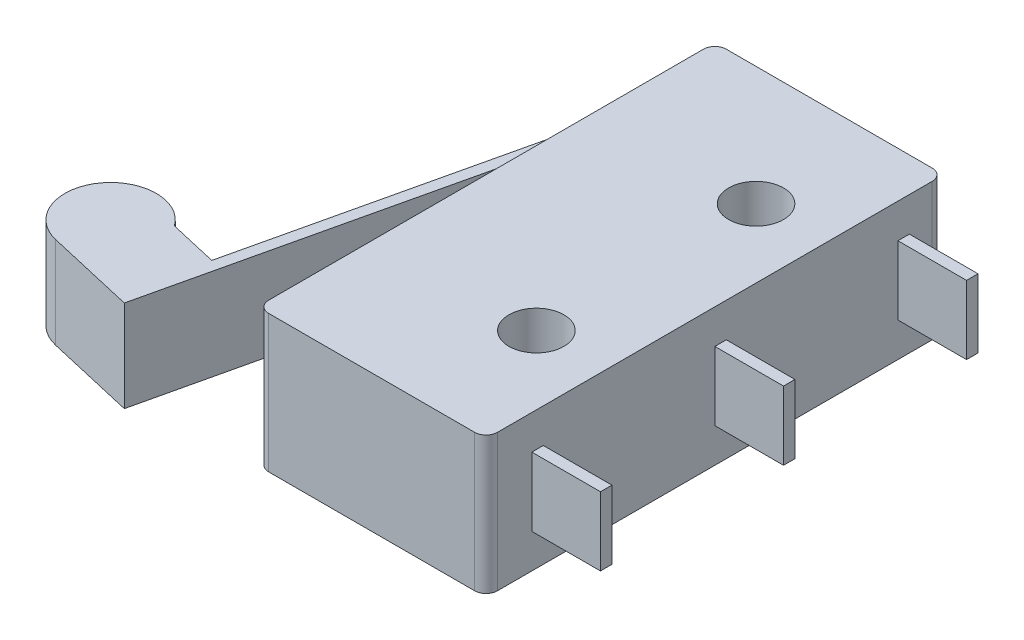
ISO-10303-21;
HEADER;
FILE_DESCRIPTION(('STEP AP214'),'2;1');
FILE_NAME('part.step','',(''),(''),'','','');
FILE_SCHEMA(('AUTOMOTIVE_DESIGN { 1 0 10303 214 1 1 1 1 }'));
ENDSEC;
DATA;
#1=APPLICATION_CONTEXT('core data for automotive mechanical design processes');
#2=APPLICATION_PROTOCOL_DEFINITION('international standard','automotive_design',2000,#1);
#3=PRODUCT_CONTEXT('',#1,'mechanical');
#4=PRODUCT('Part','Part','',(#3));
#5=PRODUCT_RELATED_PRODUCT_CATEGORY('part','',(#4));
#6=PRODUCT_DEFINITION_FORMATION('','',#4);
#7=PRODUCT_DEFINITION_CONTEXT('part definition',#1,'design');
#8=PRODUCT_DEFINITION('design','',#6,#7);
#9=PRODUCT_DEFINITION_SHAPE('','',#8);
#10=(LENGTH_UNIT() NAMED_UNIT(*) SI_UNIT(.MILLI.,.METRE.));
#11=(NAMED_UNIT(*) PLANE_ANGLE_UNIT() SI_UNIT($,.RADIAN.));
#12=(NAMED_UNIT(*) SI_UNIT($,.STERADIAN.) SOLID_ANGLE_UNIT());
#13=UNCERTAINTY_MEASURE_WITH_UNIT(LENGTH_MEASURE(1.E-05),#10,'distance_accuracy_value','');
#14=(GEOMETRIC_REPRESENTATION_CONTEXT(3) GLOBAL_UNCERTAINTY_ASSIGNED_CONTEXT((#13)) GLOBAL_UNIT_ASSIGNED_CONTEXT((#10,
#11,#12)) REPRESENTATION_CONTEXT('',''));
#15=CARTESIAN_POINT('',(0.,0.,0.));
#16=DIRECTION('',(0.,0.,1.));
#17=DIRECTION('',(1.,0.,0.));
#18=AXIS2_PLACEMENT_3D('',#15,#16,#17);
#19=CARTESIAN_POINT('',(0.,3.,0.));
#20=DIRECTION('',(0.,-1.,0.));
#21=DIRECTION('',(0.,0.,-1.));
#22=AXIS2_PLACEMENT_3D('',#19,#20,#21);
#23=PLANE('',#22);
#24=DIRECTION('',(-1.,0.,0.));
#25=VECTOR('',#24,1.);
#26=CARTESIAN_POINT('',(-5.,3.,-10.));
#27=LINE('',#26,#25);
#28=CARTESIAN_POINT('',(4.5,3.,-10.));
#29=VERTEX_POINT('',#28);
#30=CARTESIAN_POINT('',(-4.5,3.,-10.));
#31=VERTEX_POINT('',#30);
#32=EDGE_CURVE('E434',#29,#31,#27,.T.);
#33=ORIENTED_EDGE('',*,*,#32,.T.);
#34=CARTESIAN_POINT('',(-4.5,3.,-9.5));
#35=DIRECTION('',(0.,-1.,0.));
#36=DIRECTION('',(0.,0.,-1.));
#37=AXIS2_PLACEMENT_3D('',#34,#35,#36);
#38=CIRCLE('',#37,0.5);
#39=CARTESIAN_POINT('',(-5.,3.,-9.5));
#40=VERTEX_POINT('',#39);
#41=EDGE_CURVE('E496',#31,#40,#38,.F.);
#42=ORIENTED_EDGE('',*,*,#41,.T.);
#43=DIRECTION('',(0.,0.,1.));
#44=VECTOR('',#43,1.);
#45=CARTESIAN_POINT('',(-5.,3.,10.));
#46=LINE('',#45,#44);
#47=CARTESIAN_POINT('',(-5.,3.,9.5));
#48=VERTEX_POINT('',#47);
#49=EDGE_CURVE('E439',#40,#48,#46,.T.);
#50=ORIENTED_EDGE('',*,*,#49,.T.);
#51=CARTESIAN_POINT('',(-4.5,3.,9.5));
#52=DIRECTION('',(0.,-1.,0.));
#53=DIRECTION('',(0.,0.,-1.));
#54=AXIS2_PLACEMENT_3D('',#51,#52,#53);
#55=CIRCLE('',#54,0.5);
#56=CARTESIAN_POINT('',(-4.5,3.,10.));
#57=VERTEX_POINT('',#56);
#58=EDGE_CURVE('E487',#48,#57,#55,.F.);
#59=ORIENTED_EDGE('',*,*,#58,.T.);
#60=DIRECTION('',(1.,0.,0.));
#61=VECTOR('',#60,1.);
#62=CARTESIAN_POINT('',(-5.,3.,10.));
#63=LINE('',#62,#61);
#64=CARTESIAN_POINT('',(4.5,3.,10.));
#65=VERTEX_POINT('',#64);
#66=EDGE_CURVE('E443',#57,#65,#63,.T.);
#67=ORIENTED_EDGE('',*,*,#66,.T.);
#68=CARTESIAN_POINT('',(4.5,3.,9.5));
#69=DIRECTION('',(0.,-1.,0.));
#70=DIRECTION('',(0.,0.,-1.));
#71=AXIS2_PLACEMENT_3D('',#68,#69,#70);
#72=CIRCLE('',#71,0.5);
#73=CARTESIAN_POINT('',(5.,3.,9.5));
#74=VERTEX_POINT('',#73);
#75=EDGE_CURVE('E490',#65,#74,#72,.F.);
#76=ORIENTED_EDGE('',*,*,#75,.T.);
#77=DIRECTION('',(0.,0.,-1.));
#78=VECTOR('',#77,1.);
#79=CARTESIAN_POINT('',(5.,3.,10.));
#80=LINE('',#79,#78);
#81=CARTESIAN_POINT('',(5.,3.,-9.5));
#82=VERTEX_POINT('',#81);
#83=EDGE_CURVE('E430',#74,#82,#80,.T.);
#84=ORIENTED_EDGE('',*,*,#83,.T.);
#85=CARTESIAN_POINT('',(4.5,3.,-9.5));
#86=DIRECTION('',(0.,-1.,0.));
#87=DIRECTION('',(0.,0.,-1.));
#88=AXIS2_PLACEMENT_3D('',#85,#86,#87);
#89=CIRCLE('',#88,0.5);
#90=EDGE_CURVE('E493',#82,#29,#89,.F.);
#91=ORIENTED_EDGE('',*,*,#90,.T.);
#92=EDGE_LOOP('',(#33,#42,#50,#59,#67,#76,#84,#91));
#93=FACE_BOUND('',#92,.T.);
#94=CARTESIAN_POINT('',(2.,3.,-4.8));
#95=DIRECTION('',(0.,1.,0.));
#96=DIRECTION('',(0.,0.,1.));
#97=AXIS2_PLACEMENT_3D('',#94,#95,#96);
#98=CIRCLE('',#97,1.2);
#99=CARTESIAN_POINT('',(2.,3.,-3.6));
#100=VERTEX_POINT('',#99);
#101=EDGE_CURVE('E422',#100,#100,#98,.T.);
#102=ORIENTED_EDGE('',*,*,#101,.F.);
#103=EDGE_LOOP('',(#102));
#104=FACE_BOUND('',#103,.T.);
#105=CARTESIAN_POINT('',(2.,3.,4.8));
#106=DIRECTION('',(0.,1.,0.));
#107=DIRECTION('',(0.,0.,1.));
#108=AXIS2_PLACEMENT_3D('',#105,#106,#107);
#109=CIRCLE('',#108,1.2);
#110=CARTESIAN_POINT('',(2.,3.,6.));
#111=VERTEX_POINT('',#110);
#112=EDGE_CURVE('E414',#111,#111,#109,.T.);
#113=ORIENTED_EDGE('',*,*,#112,.F.);
#114=EDGE_LOOP('',(#113));
#115=FACE_BOUND('',#114,.T.);
#116=ADVANCED_FACE('F49',(#93,#104,#115),#23,.F.);
#117=CARTESIAN_POINT('',(0.,-3.,0.));
#118=DIRECTION('',(0.,-1.,0.));
#119=DIRECTION('',(0.,0.,-1.));
#120=AXIS2_PLACEMENT_3D('',#117,#118,#119);
#121=PLANE('',#120);
#122=CARTESIAN_POINT('',(2.,-3.,-4.8));
#123=DIRECTION('',(0.,1.,0.));
#124=DIRECTION('',(0.,0.,1.));
#125=AXIS2_PLACEMENT_3D('',#122,#123,#124);
#126=CIRCLE('',#125,1.2);
#127=CARTESIAN_POINT('',(2.,-3.,-3.6));
#128=VERTEX_POINT('',#127);
#129=EDGE_CURVE('E418',#128,#128,#126,.T.);
#130=ORIENTED_EDGE('',*,*,#129,.T.);
#131=EDGE_LOOP('',(#130));
#132=FACE_BOUND('',#131,.T.);
#133=DIRECTION('',(0.,0.,1.));
#134=VECTOR('',#133,1.);
#135=CARTESIAN_POINT('',(-5.,-3.,10.));
#136=LINE('',#135,#134);
#137=CARTESIAN_POINT('',(-5.,-3.,-9.5));
#138=VERTEX_POINT('',#137);
#139=CARTESIAN_POINT('',(-5.,-3.,9.5));
#140=VERTEX_POINT('',#139);
#141=EDGE_CURVE('E455',#138,#140,#136,.T.);
#142=ORIENTED_EDGE('',*,*,#141,.F.);
#143=CARTESIAN_POINT('',(-4.5,-3.,-9.5));
#144=DIRECTION('',(0.,-1.,0.));
#145=DIRECTION('',(0.,0.,-1.));
#146=AXIS2_PLACEMENT_3D('',#143,#144,#145);
#147=CIRCLE('',#146,0.5);
#148=CARTESIAN_POINT('',(-4.5,-3.,-10.));
#149=VERTEX_POINT('',#148);
#150=EDGE_CURVE('E477',#138,#149,#147,.T.);
#151=ORIENTED_EDGE('',*,*,#150,.T.);
#152=DIRECTION('',(-1.,0.,0.));
#153=VECTOR('',#152,1.);
#154=CARTESIAN_POINT('',(-5.,-3.,-10.));
#155=LINE('',#154,#153);
#156=CARTESIAN_POINT('',(4.5,-3.,-10.));
#157=VERTEX_POINT('',#156);
#158=EDGE_CURVE('E451',#157,#149,#155,.T.);
#159=ORIENTED_EDGE('',*,*,#158,.F.);
#160=CARTESIAN_POINT('',(4.5,-3.,-9.5));
#161=DIRECTION('',(0.,-1.,0.));
#162=DIRECTION('',(0.,0.,-1.));
#163=AXIS2_PLACEMENT_3D('',#160,#161,#162);
#164=CIRCLE('',#163,0.5);
#165=CARTESIAN_POINT('',(5.,-3.,-9.5));
#166=VERTEX_POINT('',#165);
#167=EDGE_CURVE('E474',#157,#166,#164,.T.);
#168=ORIENTED_EDGE('',*,*,#167,.T.);
#169=DIRECTION('',(0.,0.,-1.));
#170=VECTOR('',#169,1.);
#171=CARTESIAN_POINT('',(5.,-3.,10.));
#172=LINE('',#171,#170);
#173=CARTESIAN_POINT('',(5.,-3.,9.5));
#174=VERTEX_POINT('',#173);
#175=EDGE_CURVE('E426',#174,#166,#172,.T.);
#176=ORIENTED_EDGE('',*,*,#175,.F.);
#177=CARTESIAN_POINT('',(4.5,-3.,9.5));
#178=DIRECTION('',(0.,-1.,0.));
#179=DIRECTION('',(0.,0.,-1.));
#180=AXIS2_PLACEMENT_3D('',#177,#178,#179);
#181=CIRCLE('',#180,0.5);
#182=CARTESIAN_POINT('',(4.5,-3.,10.));
#183=VERTEX_POINT('',#182);
#184=EDGE_CURVE('E471',#174,#183,#181,.T.);
#185=ORIENTED_EDGE('',*,*,#184,.T.);
#186=DIRECTION('',(1.,0.,0.));
#187=VECTOR('',#186,1.);
#188=CARTESIAN_POINT('',(-5.,-3.,10.));
#189=LINE('',#188,#187);
#190=CARTESIAN_POINT('',(-4.5,-3.,10.));
#191=VERTEX_POINT('',#190);
#192=EDGE_CURVE('E435',#191,#183,#189,.T.);
#193=ORIENTED_EDGE('',*,*,#192,.F.);
#194=CARTESIAN_POINT('',(-4.5,-3.,9.5));
#195=DIRECTION('',(0.,-1.,0.));
#196=DIRECTION('',(0.,0.,-1.));
#197=AXIS2_PLACEMENT_3D('',#194,#195,#196);
#198=CIRCLE('',#197,0.5);
#199=EDGE_CURVE('E468',#191,#140,#198,.T.);
#200=ORIENTED_EDGE('',*,*,#199,.T.);
#201=EDGE_LOOP('',(#142,#151,#159,#168,#176,#185,#193,#200));
#202=FACE_BOUND('',#201,.T.);
#203=CARTESIAN_POINT('',(2.,-3.,4.8));
#204=DIRECTION('',(0.,1.,0.));
#205=DIRECTION('',(0.,0.,1.));
#206=AXIS2_PLACEMENT_3D('',#203,#204,#205);
#207=CIRCLE('',#206,1.2);
#208=CARTESIAN_POINT('',(2.,-3.,6.));
#209=VERTEX_POINT('',#208);
#210=EDGE_CURVE('E413',#209,#209,#207,.T.);
#211=ORIENTED_EDGE('',*,*,#210,.T.);
#212=EDGE_LOOP('',(#211));
#213=FACE_BOUND('',#212,.T.);
#214=ADVANCED_FACE('F517',(#132,#202,#213),#121,.T.);
#215=CARTESIAN_POINT('',(5.,3.,10.));
#216=DIRECTION('',(-1.,0.,0.));
#217=DIRECTION('',(0.,0.,1.));
#218=AXIS2_PLACEMENT_3D('',#215,#216,#217);
#219=PLANE('',#218);
#220=DIRECTION('',(0.,-1.,0.));
#221=VECTOR('',#220,1.);
#222=CARTESIAN_POINT('',(5.,1.5,8.));
#223=LINE('',#222,#221);
#224=CARTESIAN_POINT('',(5.,1.5,8.));
#225=VERTEX_POINT('',#224);
#226=CARTESIAN_POINT('',(5.,-1.5,8.));
#227=VERTEX_POINT('',#226);
#228=EDGE_CURVE('E65',#225,#227,#223,.T.);
#229=ORIENTED_EDGE('',*,*,#228,.F.);
#230=DIRECTION('',(0.,0.,1.));
#231=VECTOR('',#230,1.);
#232=CARTESIAN_POINT('',(5.,1.5,7.5));
#233=LINE('',#232,#231);
#234=CARTESIAN_POINT('',(5.,1.5,7.5));
#235=VERTEX_POINT('',#234);
#236=EDGE_CURVE('E70',#235,#225,#233,.T.);
#237=ORIENTED_EDGE('',*,*,#236,.F.);
#238=DIRECTION('',(0.,-1.,0.));
#239=VECTOR('',#238,1.);
#240=CARTESIAN_POINT('',(5.,1.5,7.5));
#241=LINE('',#240,#239);
#242=CARTESIAN_POINT('',(5.,-1.5,7.5));
#243=VERTEX_POINT('',#242);
#244=EDGE_CURVE('E245',#235,#243,#241,.T.);
#245=ORIENTED_EDGE('',*,*,#244,.T.);
#246=DIRECTION('',(0.,0.,1.));
#247=VECTOR('',#246,1.);
#248=CARTESIAN_POINT('',(5.,-1.5,7.5));
#249=LINE('',#248,#247);
#250=EDGE_CURVE('E249',#243,#227,#249,.T.);
#251=ORIENTED_EDGE('',*,*,#250,.T.);
#252=EDGE_LOOP('',(#229,#237,#245,#251));
#253=FACE_BOUND('',#252,.T.);
#254=DIRECTION('',(0.,-1.,0.));
#255=VECTOR('',#254,1.);
#256=CARTESIAN_POINT('',(5.,1.5,0.));
#257=LINE('',#256,#255);
#258=CARTESIAN_POINT('',(5.,1.5,0.));
#259=VERTEX_POINT('',#258);
#260=CARTESIAN_POINT('',(5.,-1.5,0.));
#261=VERTEX_POINT('',#260);
#262=EDGE_CURVE('E305',#259,#261,#257,.T.);
#263=ORIENTED_EDGE('',*,*,#262,.F.);
#264=DIRECTION('',(0.,0.,1.));
#265=VECTOR('',#264,1.);
#266=CARTESIAN_POINT('',(5.,1.5,-0.5));
#267=LINE('',#266,#265);
#268=CARTESIAN_POINT('',(5.,1.5,-0.5));
#269=VERTEX_POINT('',#268);
#270=EDGE_CURVE('E268',#269,#259,#267,.T.);
#271=ORIENTED_EDGE('',*,*,#270,.F.);
#272=DIRECTION('',(0.,-1.,0.));
#273=VECTOR('',#272,1.);
#274=CARTESIAN_POINT('',(5.,1.5,-0.5));
#275=LINE('',#274,#273);
#276=CARTESIAN_POINT('',(5.,-1.5,-0.5));
#277=VERTEX_POINT('',#276);
#278=EDGE_CURVE('E283',#269,#277,#275,.T.);
#279=ORIENTED_EDGE('',*,*,#278,.T.);
#280=DIRECTION('',(0.,0.,1.));
#281=VECTOR('',#280,1.);
#282=CARTESIAN_POINT('',(5.,-1.5,-0.5));
#283=LINE('',#282,#281);
#284=EDGE_CURVE('E267',#277,#261,#283,.T.);
#285=ORIENTED_EDGE('',*,*,#284,.T.);
#286=EDGE_LOOP('',(#263,#271,#279,#285));
#287=FACE_BOUND('',#286,.T.);
#288=DIRECTION('',(0.,-1.,0.));
#289=VECTOR('',#288,1.);
#290=CARTESIAN_POINT('',(5.,1.5,-8.));
#291=LINE('',#290,#289);
#292=CARTESIAN_POINT('',(5.,1.5,-8.));
#293=VERTEX_POINT('',#292);
#294=CARTESIAN_POINT('',(5.,-1.5,-8.));
#295=VERTEX_POINT('',#294);
#296=EDGE_CURVE('E347',#293,#295,#291,.T.);
#297=ORIENTED_EDGE('',*,*,#296,.F.);
#298=DIRECTION('',(0.,0.,1.));
#299=VECTOR('',#298,1.);
#300=CARTESIAN_POINT('',(5.,1.5,-8.5));
#301=LINE('',#300,#299);
#302=CARTESIAN_POINT('',(5.,1.5,-8.5));
#303=VERTEX_POINT('',#302);
#304=EDGE_CURVE('E310',#303,#293,#301,.T.);
#305=ORIENTED_EDGE('',*,*,#304,.F.);
#306=DIRECTION('',(0.,-1.,0.));
#307=VECTOR('',#306,1.);
#308=CARTESIAN_POINT('',(5.,1.5,-8.5));
#309=LINE('',#308,#307);
#310=CARTESIAN_POINT('',(5.,-1.5,-8.5));
#311=VERTEX_POINT('',#310);
#312=EDGE_CURVE('E325',#303,#311,#309,.T.);
#313=ORIENTED_EDGE('',*,*,#312,.T.);
#314=DIRECTION('',(0.,0.,1.));
#315=VECTOR('',#314,1.);
#316=CARTESIAN_POINT('',(5.,-1.5,-8.5));
#317=LINE('',#316,#315);
#318=EDGE_CURVE('E309',#311,#295,#317,.T.);
#319=ORIENTED_EDGE('',*,*,#318,.T.);
#320=EDGE_LOOP('',(#297,#305,#313,#319));
#321=FACE_BOUND('',#320,.T.);
#322=ORIENTED_EDGE('',*,*,#175,.T.);
#323=DIRECTION('',(0.,-1.,0.));
#324=VECTOR('',#323,1.);
#325=CARTESIAN_POINT('',(5.,3.,-9.5));
#326=LINE('',#325,#324);
#327=EDGE_CURVE('E503',#166,#82,#326,.F.);
#328=ORIENTED_EDGE('',*,*,#327,.T.);
#329=ORIENTED_EDGE('',*,*,#83,.F.);
#330=DIRECTION('',(0.,-1.,0.));
#331=VECTOR('',#330,1.);
#332=CARTESIAN_POINT('',(5.,3.,9.5));
#333=LINE('',#332,#331);
#334=EDGE_CURVE('E499',#74,#174,#333,.T.);
#335=ORIENTED_EDGE('',*,*,#334,.T.);
#336=EDGE_LOOP('',(#322,#328,#329,#335));
#337=FACE_BOUND('',#336,.T.);
#338=ADVANCED_FACE('F526',(#253,#287,#321,#337),#219,.F.);
#339=CARTESIAN_POINT('',(-5.,3.,-10.));
#340=DIRECTION('',(0.,0.,1.));
#341=DIRECTION('',(1.,0.,0.));
#342=AXIS2_PLACEMENT_3D('',#339,#340,#341);
#343=PLANE('',#342);
#344=ORIENTED_EDGE('',*,*,#158,.T.);
#345=DIRECTION('',(0.,-1.,0.));
#346=VECTOR('',#345,1.);
#347=CARTESIAN_POINT('',(-4.5,3.,-10.));
#348=LINE('',#347,#346);
#349=EDGE_CURVE('E484',#149,#31,#348,.F.);
#350=ORIENTED_EDGE('',*,*,#349,.T.);
#351=ORIENTED_EDGE('',*,*,#32,.F.);
#352=DIRECTION('',(0.,-1.,0.));
#353=VECTOR('',#352,1.);
#354=CARTESIAN_POINT('',(4.5,3.,-10.));
#355=LINE('',#354,#353);
#356=EDGE_CURVE('E480',#29,#157,#355,.T.);
#357=ORIENTED_EDGE('',*,*,#356,.T.);
#358=EDGE_LOOP('',(#344,#350,#351,#357));
#359=FACE_BOUND('',#358,.T.);
#360=ADVANCED_FACE('F537',(#359),#343,.F.);
#361=CARTESIAN_POINT('',(-5.,3.,10.));
#362=DIRECTION('',(1.,0.,0.));
#363=DIRECTION('',(0.,0.,-1.));
#364=AXIS2_PLACEMENT_3D('',#361,#362,#363);
#365=PLANE('',#364);
#366=DIRECTION('',(0.,-1.,0.));
#367=VECTOR('',#366,1.);
#368=CARTESIAN_POINT('',(-5.,2.,-8.));
#369=LINE('',#368,#367);
#370=CARTESIAN_POINT('',(-5.,2.,-8.));
#371=VERTEX_POINT('',#370);
#372=CARTESIAN_POINT('',(-5.,-2.,-8.));
#373=VERTEX_POINT('',#372);
#374=EDGE_CURVE('E409',#371,#373,#369,.T.);
#375=ORIENTED_EDGE('',*,*,#374,.F.);
#376=DIRECTION('',(0.,0.,-1.));
#377=VECTOR('',#376,1.);
#378=CARTESIAN_POINT('',(-5.,2.,-5.77729425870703));
#379=LINE('',#378,#377);
#380=CARTESIAN_POINT('',(-5.,2.,-5.77729425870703));
#381=VERTEX_POINT('',#380);
#382=EDGE_CURVE('E352',#381,#371,#379,.T.);
#383=ORIENTED_EDGE('',*,*,#382,.F.);
#384=DIRECTION('',(0.,-1.,0.));
#385=VECTOR('',#384,1.);
#386=CARTESIAN_POINT('',(-5.,2.,-5.77729425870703));
#387=LINE('',#386,#385);
#388=CARTESIAN_POINT('',(-5.,-2.,-5.77729425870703));
#389=VERTEX_POINT('',#388);
#390=EDGE_CURVE('E373',#381,#389,#387,.T.);
#391=ORIENTED_EDGE('',*,*,#390,.T.);
#392=DIRECTION('',(0.,0.,-1.));
#393=VECTOR('',#392,1.);
#394=CARTESIAN_POINT('',(-5.,-2.,-5.77729425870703));
#395=LINE('',#394,#393);
#396=EDGE_CURVE('E351',#389,#373,#395,.T.);
#397=ORIENTED_EDGE('',*,*,#396,.T.);
#398=EDGE_LOOP('',(#375,#383,#391,#397));
#399=FACE_BOUND('',#398,.T.);
#400=ORIENTED_EDGE('',*,*,#49,.F.);
#401=DIRECTION('',(0.,-1.,0.));
#402=VECTOR('',#401,1.);
#403=CARTESIAN_POINT('',(-5.,3.,-9.5));
#404=LINE('',#403,#402);
#405=EDGE_CURVE('E464',#40,#138,#404,.T.);
#406=ORIENTED_EDGE('',*,*,#405,.T.);
#407=ORIENTED_EDGE('',*,*,#141,.T.);
#408=DIRECTION('',(0.,-1.,0.));
#409=VECTOR('',#408,1.);
#410=CARTESIAN_POINT('',(-5.,3.,9.5));
#411=LINE('',#410,#409);
#412=EDGE_CURVE('E447',#140,#48,#411,.F.);
#413=ORIENTED_EDGE('',*,*,#412,.T.);
#414=EDGE_LOOP('',(#400,#406,#407,#413));
#415=FACE_BOUND('',#414,.T.);
#416=ADVANCED_FACE('F545',(#399,#415),#365,.F.);
#417=CARTESIAN_POINT('',(-5.,3.,10.));
#418=DIRECTION('',(0.,0.,-1.));
#419=DIRECTION('',(-1.,0.,0.));
#420=AXIS2_PLACEMENT_3D('',#417,#418,#419);
#421=PLANE('',#420);
#422=ORIENTED_EDGE('',*,*,#192,.T.);
#423=DIRECTION('',(0.,-1.,0.));
#424=VECTOR('',#423,1.);
#425=CARTESIAN_POINT('',(4.5,3.,10.));
#426=LINE('',#425,#424);
#427=EDGE_CURVE('E11',#183,#65,#426,.F.);
#428=ORIENTED_EDGE('',*,*,#427,.T.);
#429=ORIENTED_EDGE('',*,*,#66,.F.);
#430=DIRECTION('',(0.,-1.,0.));
#431=VECTOR('',#430,1.);
#432=CARTESIAN_POINT('',(-4.5,3.,10.));
#433=LINE('',#432,#431);
#434=EDGE_CURVE('E58',#57,#191,#433,.T.);
#435=ORIENTED_EDGE('',*,*,#434,.T.);
#436=EDGE_LOOP('',(#422,#428,#429,#435));
#437=FACE_BOUND('',#436,.T.);
#438=ADVANCED_FACE('F511',(#437),#421,.F.);
#439=CARTESIAN_POINT('',(2.,3.,-4.8));
#440=DIRECTION('',(0.,-1.,0.));
#441=DIRECTION('',(0.,0.,-1.));
#442=AXIS2_PLACEMENT_3D('',#439,#440,#441);
#443=CYLINDRICAL_SURFACE('',#442,1.2);
#444=ORIENTED_EDGE('',*,*,#101,.T.);
#445=EDGE_LOOP('',(#444));
#446=FACE_BOUND('',#445,.T.);
#447=ORIENTED_EDGE('',*,*,#129,.F.);
#448=EDGE_LOOP('',(#447));
#449=FACE_BOUND('',#448,.T.);
#450=ADVANCED_FACE('F564',(#446,#449),#443,.F.);
#451=CARTESIAN_POINT('',(2.,3.,4.8));
#452=DIRECTION('',(0.,-1.,0.));
#453=DIRECTION('',(0.,0.,-1.));
#454=AXIS2_PLACEMENT_3D('',#451,#452,#453);
#455=CYLINDRICAL_SURFACE('',#454,1.2);
#456=ORIENTED_EDGE('',*,*,#112,.T.);
#457=EDGE_LOOP('',(#456));
#458=FACE_BOUND('',#457,.T.);
#459=ORIENTED_EDGE('',*,*,#210,.F.);
#460=EDGE_LOOP('',(#459));
#461=FACE_BOUND('',#460,.T.);
#462=ADVANCED_FACE('F826',(#458,#461),#455,.F.);
#463=CARTESIAN_POINT('',(-5.,2.,-8.));
#464=DIRECTION('',(0.974370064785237,0.,0.224951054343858));
#465=DIRECTION('',(0.224951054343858,0.,-0.974370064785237));
#466=AXIS2_PLACEMENT_3D('',#463,#464,#465);
#467=PLANE('',#466);
#468=DIRECTION('',(-0.224951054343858,0.,0.974370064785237));
#469=VECTOR('',#468,1.);
#470=CARTESIAN_POINT('',(-5.,-2.,-8.));
#471=LINE('',#470,#469);
#472=CARTESIAN_POINT('',(-8.74897532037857,-2.,8.23859615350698));
#473=VERTEX_POINT('',#472);
#474=EDGE_CURVE('E376',#373,#473,#471,.T.);
#475=ORIENTED_EDGE('',*,*,#474,.T.);
#476=DIRECTION('',(0.,-1.,0.));
#477=VECTOR('',#476,1.);
#478=CARTESIAN_POINT('',(-8.74897532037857,2.,8.23859615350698));
#479=LINE('',#478,#477);
#480=CARTESIAN_POINT('',(-8.74897532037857,2.,8.23859615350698));
#481=VERTEX_POINT('',#480);
#482=EDGE_CURVE('E405',#481,#473,#479,.T.);
#483=ORIENTED_EDGE('',*,*,#482,.F.);
#484=DIRECTION('',(-0.224951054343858,0.,0.974370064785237));
#485=VECTOR('',#484,1.);
#486=CARTESIAN_POINT('',(-5.,2.,-8.));
#487=LINE('',#486,#485);
#488=EDGE_CURVE('E356',#371,#481,#487,.T.);
#489=ORIENTED_EDGE('',*,*,#488,.F.);
#490=ORIENTED_EDGE('',*,*,#374,.T.);
#491=EDGE_LOOP('',(#475,#483,#489,#490));
#492=FACE_BOUND('',#491,.T.);
#493=ADVANCED_FACE('F817',(#492),#467,.F.);
#494=CARTESIAN_POINT('',(-8.74897532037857,2.,8.23859615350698));
#495=DIRECTION('',(-0.224951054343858,0.,0.974370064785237));
#496=DIRECTION('',(0.974370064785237,0.,0.224951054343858));
#497=AXIS2_PLACEMENT_3D('',#494,#495,#496);
#498=PLANE('',#497);
#499=DIRECTION('',(-0.974370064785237,0.,-0.224951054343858));
#500=VECTOR('',#499,1.);
#501=CARTESIAN_POINT('',(-8.74897532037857,-2.,8.23859615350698));
#502=LINE('',#501,#500);
#503=CARTESIAN_POINT('',(-10.8703001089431,-2.,7.74884973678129));
#504=VERTEX_POINT('',#503);
#505=EDGE_CURVE('E379',#473,#504,#502,.T.);
#506=ORIENTED_EDGE('',*,*,#505,.T.);
#507=DIRECTION('',(0.,-1.,0.));
#508=VECTOR('',#507,1.);
#509=CARTESIAN_POINT('',(-10.8703001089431,2.,7.74884973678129));
#510=LINE('',#509,#508);
#511=CARTESIAN_POINT('',(-10.8703001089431,2.,7.74884973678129));
#512=VERTEX_POINT('',#511);
#513=EDGE_CURVE('E401',#512,#504,#510,.T.);
#514=ORIENTED_EDGE('',*,*,#513,.F.);
#515=DIRECTION('',(-0.974370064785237,0.,-0.224951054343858));
#516=VECTOR('',#515,1.);
#517=CARTESIAN_POINT('',(-8.74897532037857,2.,8.23859615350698));
#518=LINE('',#517,#516);
#519=EDGE_CURVE('E360',#481,#512,#518,.T.);
#520=ORIENTED_EDGE('',*,*,#519,.F.);
#521=ORIENTED_EDGE('',*,*,#482,.T.);
#522=EDGE_LOOP('',(#506,#514,#520,#521));
#523=FACE_BOUND('',#522,.T.);
#524=ADVANCED_FACE('F808',(#523),#498,.F.);
#525=CARTESIAN_POINT('',(-12.4966971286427,2.,8.91282256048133));
#526=DIRECTION('',(0.,-1.,0.));
#527=DIRECTION('',(0.,0.,-1.));
#528=AXIS2_PLACEMENT_3D('',#525,#526,#527);
#529=CYLINDRICAL_SURFACE('',#528,2.);
#530=CARTESIAN_POINT('',(-12.4966971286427,-2.,8.91282256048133));
#531=DIRECTION('',(0.,1.,0.));
#532=DIRECTION('',(0.,0.,1.));
#533=AXIS2_PLACEMENT_3D('',#530,#531,#532);
#534=CIRCLE('',#533,2.);
#535=CARTESIAN_POINT('',(-12.9465992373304,-2.,10.8615626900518));
#536=VERTEX_POINT('',#535);
#537=EDGE_CURVE('E382',#504,#536,#534,.T.);
#538=ORIENTED_EDGE('',*,*,#537,.T.);
#539=DIRECTION('',(0.,-1.,0.));
#540=VECTOR('',#539,1.);
#541=CARTESIAN_POINT('',(-12.9465992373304,2.,10.8615626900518));
#542=LINE('',#541,#540);
#543=CARTESIAN_POINT('',(-12.9465992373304,2.,10.8615626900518));
#544=VERTEX_POINT('',#543);
#545=EDGE_CURVE('E397',#544,#536,#542,.T.);
#546=ORIENTED_EDGE('',*,*,#545,.F.);
#547=CARTESIAN_POINT('',(-12.4966971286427,2.,8.91282256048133));
#548=DIRECTION('',(0.,1.,0.));
#549=DIRECTION('',(0.,0.,1.));
#550=AXIS2_PLACEMENT_3D('',#547,#548,#549);
#551=CIRCLE('',#550,2.);
#552=EDGE_CURVE('E363',#512,#544,#551,.T.);
#553=ORIENTED_EDGE('',*,*,#552,.F.);
#554=ORIENTED_EDGE('',*,*,#513,.T.);
#555=EDGE_LOOP('',(#538,#546,#553,#554));
#556=FACE_BOUND('',#555,.T.);
#557=ADVANCED_FACE('F799',(#556),#529,.T.);
#558=CARTESIAN_POINT('',(-9.04911897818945,2.,11.7613669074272));
#559=DIRECTION('',(0.224951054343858,0.,-0.974370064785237));
#560=DIRECTION('',(-0.974370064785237,0.,-0.224951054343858));
#561=AXIS2_PLACEMENT_3D('',#558,#559,#560);
#562=PLANE('',#561);
#563=DIRECTION('',(0.974370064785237,0.,0.224951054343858));
#564=VECTOR('',#563,1.);
#565=CARTESIAN_POINT('',(-9.04911897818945,-2.,11.7613669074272));
#566=LINE('',#565,#564);
#567=CARTESIAN_POINT('',(-9.04911897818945,-2.,11.7613669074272));
#568=VERTEX_POINT('',#567);
#569=EDGE_CURVE('E385',#536,#568,#566,.T.);
#570=ORIENTED_EDGE('',*,*,#569,.T.);
#571=DIRECTION('',(0.,-1.,0.));
#572=VECTOR('',#571,1.);
#573=CARTESIAN_POINT('',(-9.04911897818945,2.,11.7613669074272));
#574=LINE('',#573,#572);
#575=CARTESIAN_POINT('',(-9.04911897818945,2.,11.7613669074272));
#576=VERTEX_POINT('',#575);
#577=EDGE_CURVE('E393',#576,#568,#574,.T.);
#578=ORIENTED_EDGE('',*,*,#577,.F.);
#579=DIRECTION('',(0.974370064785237,0.,0.224951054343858));
#580=VECTOR('',#579,1.);
#581=CARTESIAN_POINT('',(-9.04911897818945,2.,11.7613669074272));
#582=LINE('',#581,#580);
#583=EDGE_CURVE('E366',#544,#576,#582,.T.);
#584=ORIENTED_EDGE('',*,*,#583,.F.);
#585=ORIENTED_EDGE('',*,*,#545,.T.);
#586=EDGE_LOOP('',(#570,#578,#584,#585));
#587=FACE_BOUND('',#586,.T.);
#588=ADVANCED_FACE('F790',(#587),#562,.F.);
#589=CARTESIAN_POINT('',(-9.04911897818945,2.,11.7613669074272));
#590=DIRECTION('',(-0.974370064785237,0.,-0.224951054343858));
#591=DIRECTION('',(-0.224951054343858,0.,0.974370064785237));
#592=AXIS2_PLACEMENT_3D('',#589,#590,#591);
#593=PLANE('',#592);
#594=DIRECTION('',(0.224951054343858,0.,-0.974370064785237));
#595=VECTOR('',#594,1.);
#596=CARTESIAN_POINT('',(-9.04911897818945,-2.,11.7613669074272));
#597=LINE('',#596,#595);
#598=EDGE_CURVE('E357',#568,#389,#597,.T.);
#599=ORIENTED_EDGE('',*,*,#598,.T.);
#600=ORIENTED_EDGE('',*,*,#390,.F.);
#601=DIRECTION('',(0.224951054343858,0.,-0.974370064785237));
#602=VECTOR('',#601,1.);
#603=CARTESIAN_POINT('',(-9.04911897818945,2.,11.7613669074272));
#604=LINE('',#603,#602);
#605=EDGE_CURVE('E369',#576,#381,#604,.T.);
#606=ORIENTED_EDGE('',*,*,#605,.F.);
#607=ORIENTED_EDGE('',*,*,#577,.T.);
#608=EDGE_LOOP('',(#599,#600,#606,#607));
#609=FACE_BOUND('',#608,.T.);
#610=ADVANCED_FACE('F781',(#609),#593,.F.);
#611=CARTESIAN_POINT('',(-12.4966971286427,2.,8.91282256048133));
#612=DIRECTION('',(0.,1.,0.));
#613=DIRECTION('',(0.,0.,1.));
#614=AXIS2_PLACEMENT_3D('',#611,#612,#613);
#615=PLANE('',#614);
#616=ORIENTED_EDGE('',*,*,#382,.T.);
#617=ORIENTED_EDGE('',*,*,#488,.T.);
#618=ORIENTED_EDGE('',*,*,#519,.T.);
#619=ORIENTED_EDGE('',*,*,#552,.T.);
#620=ORIENTED_EDGE('',*,*,#583,.T.);
#621=ORIENTED_EDGE('',*,*,#605,.T.);
#622=EDGE_LOOP('',(#616,#617,#618,#619,#620,#621));
#623=FACE_BOUND('',#622,.T.);
#624=ADVANCED_FACE('F772',(#623),#615,.T.);
#625=CARTESIAN_POINT('',(-12.4966971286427,-2.,8.91282256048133));
#626=DIRECTION('',(0.,1.,0.));
#627=DIRECTION('',(0.,0.,1.));
#628=AXIS2_PLACEMENT_3D('',#625,#626,#627);
#629=PLANE('',#628);
#630=ORIENTED_EDGE('',*,*,#396,.F.);
#631=ORIENTED_EDGE('',*,*,#598,.F.);
#632=ORIENTED_EDGE('',*,*,#569,.F.);
#633=ORIENTED_EDGE('',*,*,#537,.F.);
#634=ORIENTED_EDGE('',*,*,#505,.F.);
#635=ORIENTED_EDGE('',*,*,#474,.F.);
#636=EDGE_LOOP('',(#630,#631,#632,#633,#634,#635));
#637=FACE_BOUND('',#636,.T.);
#638=ADVANCED_FACE('F578',(#637),#629,.F.);
#639=CARTESIAN_POINT('',(-4.5,3.,-9.5));
#640=DIRECTION('',(0.,-1.,0.));
#641=DIRECTION('',(0.,0.,-1.));
#642=AXIS2_PLACEMENT_3D('',#639,#640,#641);
#643=CYLINDRICAL_SURFACE('',#642,0.5);
#644=ORIENTED_EDGE('',*,*,#41,.F.);
#645=ORIENTED_EDGE('',*,*,#349,.F.);
#646=ORIENTED_EDGE('',*,*,#150,.F.);
#647=ORIENTED_EDGE('',*,*,#405,.F.);
#648=EDGE_LOOP('',(#644,#645,#646,#647));
#649=FACE_BOUND('',#648,.T.);
#650=ADVANCED_FACE('F542',(#649),#643,.T.);
#651=CARTESIAN_POINT('',(4.5,3.,-9.5));
#652=DIRECTION('',(0.,-1.,0.));
#653=DIRECTION('',(0.,0.,-1.));
#654=AXIS2_PLACEMENT_3D('',#651,#652,#653);
#655=CYLINDRICAL_SURFACE('',#654,0.5);
#656=ORIENTED_EDGE('',*,*,#90,.F.);
#657=ORIENTED_EDGE('',*,*,#327,.F.);
#658=ORIENTED_EDGE('',*,*,#167,.F.);
#659=ORIENTED_EDGE('',*,*,#356,.F.);
#660=EDGE_LOOP('',(#656,#657,#658,#659));
#661=FACE_BOUND('',#660,.T.);
#662=ADVANCED_FACE('F534',(#661),#655,.T.);
#663=CARTESIAN_POINT('',(4.5,3.,9.5));
#664=DIRECTION('',(0.,-1.,0.));
#665=DIRECTION('',(0.,0.,-1.));
#666=AXIS2_PLACEMENT_3D('',#663,#664,#665);
#667=CYLINDRICAL_SURFACE('',#666,0.5);
#668=ORIENTED_EDGE('',*,*,#75,.F.);
#669=ORIENTED_EDGE('',*,*,#427,.F.);
#670=ORIENTED_EDGE('',*,*,#184,.F.);
#671=ORIENTED_EDGE('',*,*,#334,.F.);
#672=EDGE_LOOP('',(#668,#669,#670,#671));
#673=FACE_BOUND('',#672,.T.);
#674=ADVANCED_FACE('F523',(#673),#667,.T.);
#675=CARTESIAN_POINT('',(-4.5,3.,9.5));
#676=DIRECTION('',(0.,-1.,0.));
#677=DIRECTION('',(0.,0.,-1.));
#678=AXIS2_PLACEMENT_3D('',#675,#676,#677);
#679=CYLINDRICAL_SURFACE('',#678,0.5);
#680=ORIENTED_EDGE('',*,*,#58,.F.);
#681=ORIENTED_EDGE('',*,*,#412,.F.);
#682=ORIENTED_EDGE('',*,*,#199,.F.);
#683=ORIENTED_EDGE('',*,*,#434,.F.);
#684=EDGE_LOOP('',(#680,#681,#682,#683));
#685=FACE_BOUND('',#684,.T.);
#686=ADVANCED_FACE('F51',(#685),#679,.T.);
#687=CARTESIAN_POINT('',(5.,1.5,-8.));
#688=DIRECTION('',(0.,0.,-1.));
#689=DIRECTION('',(-1.,0.,0.));
#690=AXIS2_PLACEMENT_3D('',#687,#688,#689);
#691=PLANE('',#690);
#692=DIRECTION('',(1.,0.,0.));
#693=VECTOR('',#692,1.);
#694=CARTESIAN_POINT('',(5.,-1.5,-8.));
#695=LINE('',#694,#693);
#696=CARTESIAN_POINT('',(8.,-1.5,-8.));
#697=VERTEX_POINT('',#696);
#698=EDGE_CURVE('E328',#295,#697,#695,.T.);
#699=ORIENTED_EDGE('',*,*,#698,.T.);
#700=DIRECTION('',(0.,-1.,0.));
#701=VECTOR('',#700,1.);
#702=CARTESIAN_POINT('',(8.,1.5,-8.));
#703=LINE('',#702,#701);
#704=CARTESIAN_POINT('',(8.,1.5,-8.));
#705=VERTEX_POINT('',#704);
#706=EDGE_CURVE('E343',#705,#697,#703,.T.);
#707=ORIENTED_EDGE('',*,*,#706,.F.);
#708=DIRECTION('',(1.,0.,0.));
#709=VECTOR('',#708,1.);
#710=CARTESIAN_POINT('',(5.,1.5,-8.));
#711=LINE('',#710,#709);
#712=EDGE_CURVE('E314',#293,#705,#711,.T.);
#713=ORIENTED_EDGE('',*,*,#712,.F.);
#714=ORIENTED_EDGE('',*,*,#296,.T.);
#715=EDGE_LOOP('',(#699,#707,#713,#714));
#716=FACE_BOUND('',#715,.T.);
#717=ADVANCED_FACE('F548',(#716),#691,.F.);
#718=CARTESIAN_POINT('',(8.,1.5,-8.5));
#719=DIRECTION('',(-1.,0.,0.));
#720=DIRECTION('',(0.,0.,1.));
#721=AXIS2_PLACEMENT_3D('',#718,#719,#720);
#722=PLANE('',#721);
#723=DIRECTION('',(0.,0.,-1.));
#724=VECTOR('',#723,1.);
#725=CARTESIAN_POINT('',(8.,-1.5,-8.5));
#726=LINE('',#725,#724);
#727=CARTESIAN_POINT('',(8.,-1.5,-8.5));
#728=VERTEX_POINT('',#727);
#729=EDGE_CURVE('E331',#697,#728,#726,.T.);
#730=ORIENTED_EDGE('',*,*,#729,.T.);
#731=DIRECTION('',(0.,-1.,0.));
#732=VECTOR('',#731,1.);
#733=CARTESIAN_POINT('',(8.,1.5,-8.5));
#734=LINE('',#733,#732);
#735=CARTESIAN_POINT('',(8.,1.5,-8.5));
#736=VERTEX_POINT('',#735);
#737=EDGE_CURVE('E339',#736,#728,#734,.T.);
#738=ORIENTED_EDGE('',*,*,#737,.F.);
#739=DIRECTION('',(0.,0.,-1.));
#740=VECTOR('',#739,1.);
#741=CARTESIAN_POINT('',(8.,1.5,-8.5));
#742=LINE('',#741,#740);
#743=EDGE_CURVE('E318',#705,#736,#742,.T.);
#744=ORIENTED_EDGE('',*,*,#743,.F.);
#745=ORIENTED_EDGE('',*,*,#706,.T.);
#746=EDGE_LOOP('',(#730,#738,#744,#745));
#747=FACE_BOUND('',#746,.T.);
#748=ADVANCED_FACE('F553',(#747),#722,.F.);
#749=CARTESIAN_POINT('',(5.,1.5,-8.5));
#750=DIRECTION('',(0.,0.,1.));
#751=DIRECTION('',(1.,0.,0.));
#752=AXIS2_PLACEMENT_3D('',#749,#750,#751);
#753=PLANE('',#752);
#754=DIRECTION('',(-1.,0.,0.));
#755=VECTOR('',#754,1.);
#756=CARTESIAN_POINT('',(5.,-1.5,-8.5));
#757=LINE('',#756,#755);
#758=EDGE_CURVE('E315',#728,#311,#757,.T.);
#759=ORIENTED_EDGE('',*,*,#758,.T.);
#760=ORIENTED_EDGE('',*,*,#312,.F.);
#761=DIRECTION('',(-1.,0.,0.));
#762=VECTOR('',#761,1.);
#763=CARTESIAN_POINT('',(5.,1.5,-8.5));
#764=LINE('',#763,#762);
#765=EDGE_CURVE('E321',#736,#303,#764,.T.);
#766=ORIENTED_EDGE('',*,*,#765,.F.);
#767=ORIENTED_EDGE('',*,*,#737,.T.);
#768=EDGE_LOOP('',(#759,#760,#766,#767));
#769=FACE_BOUND('',#768,.T.);
#770=ADVANCED_FACE('F609',(#769),#753,.F.);
#771=CARTESIAN_POINT('',(0.,1.5,0.));
#772=DIRECTION('',(0.,1.,0.));
#773=DIRECTION('',(0.,0.,1.));
#774=AXIS2_PLACEMENT_3D('',#771,#772,#773);
#775=PLANE('',#774);
#776=ORIENTED_EDGE('',*,*,#304,.T.);
#777=ORIENTED_EDGE('',*,*,#712,.T.);
#778=ORIENTED_EDGE('',*,*,#743,.T.);
#779=ORIENTED_EDGE('',*,*,#765,.T.);
#780=EDGE_LOOP('',(#776,#777,#778,#779));
#781=FACE_BOUND('',#780,.T.);
#782=ADVANCED_FACE('F618',(#781),#775,.T.);
#783=CARTESIAN_POINT('',(0.,-1.5,0.));
#784=DIRECTION('',(0.,1.,0.));
#785=DIRECTION('',(0.,0.,1.));
#786=AXIS2_PLACEMENT_3D('',#783,#784,#785);
#787=PLANE('',#786);
#788=ORIENTED_EDGE('',*,*,#318,.F.);
#789=ORIENTED_EDGE('',*,*,#758,.F.);
#790=ORIENTED_EDGE('',*,*,#729,.F.);
#791=ORIENTED_EDGE('',*,*,#698,.F.);
#792=EDGE_LOOP('',(#788,#789,#790,#791));
#793=FACE_BOUND('',#792,.T.);
#794=ADVANCED_FACE('F627',(#793),#787,.F.);
#795=CARTESIAN_POINT('',(5.,1.5,0.));
#796=DIRECTION('',(0.,0.,-1.));
#797=DIRECTION('',(-1.,0.,0.));
#798=AXIS2_PLACEMENT_3D('',#795,#796,#797);
#799=PLANE('',#798);
#800=DIRECTION('',(1.,0.,0.));
#801=VECTOR('',#800,1.);
#802=CARTESIAN_POINT('',(5.,-1.5,0.));
#803=LINE('',#802,#801);
#804=CARTESIAN_POINT('',(8.,-1.5,0.));
#805=VERTEX_POINT('',#804);
#806=EDGE_CURVE('E286',#261,#805,#803,.T.);
#807=ORIENTED_EDGE('',*,*,#806,.T.);
#808=DIRECTION('',(0.,-1.,0.));
#809=VECTOR('',#808,1.);
#810=CARTESIAN_POINT('',(8.,1.5,0.));
#811=LINE('',#810,#809);
#812=CARTESIAN_POINT('',(8.,1.5,0.));
#813=VERTEX_POINT('',#812);
#814=EDGE_CURVE('E301',#813,#805,#811,.T.);
#815=ORIENTED_EDGE('',*,*,#814,.F.);
#816=DIRECTION('',(1.,0.,0.));
#817=VECTOR('',#816,1.);
#818=CARTESIAN_POINT('',(5.,1.5,0.));
#819=LINE('',#818,#817);
#820=EDGE_CURVE('E272',#259,#813,#819,.T.);
#821=ORIENTED_EDGE('',*,*,#820,.F.);
#822=ORIENTED_EDGE('',*,*,#262,.T.);
#823=EDGE_LOOP('',(#807,#815,#821,#822));
#824=FACE_BOUND('',#823,.T.);
#825=ADVANCED_FACE('F636',(#824),#799,.F.);
#826=CARTESIAN_POINT('',(8.,1.5,-0.499999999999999));
#827=DIRECTION('',(-1.,0.,0.));
#828=DIRECTION('',(0.,0.,1.));
#829=AXIS2_PLACEMENT_3D('',#826,#827,#828);
#830=PLANE('',#829);
#831=DIRECTION('',(0.,0.,-1.));
#832=VECTOR('',#831,1.);
#833=CARTESIAN_POINT('',(8.,-1.5,-0.499999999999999));
#834=LINE('',#833,#832);
#835=CARTESIAN_POINT('',(8.,-1.5,-0.499999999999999));
#836=VERTEX_POINT('',#835);
#837=EDGE_CURVE('E289',#805,#836,#834,.T.);
#838=ORIENTED_EDGE('',*,*,#837,.T.);
#839=DIRECTION('',(0.,-1.,0.));
#840=VECTOR('',#839,1.);
#841=CARTESIAN_POINT('',(8.,1.5,-0.499999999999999));
#842=LINE('',#841,#840);
#843=CARTESIAN_POINT('',(8.,1.5,-0.499999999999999));
#844=VERTEX_POINT('',#843);
#845=EDGE_CURVE('E297',#844,#836,#842,.T.);
#846=ORIENTED_EDGE('',*,*,#845,.F.);
#847=DIRECTION('',(0.,0.,-1.));
#848=VECTOR('',#847,1.);
#849=CARTESIAN_POINT('',(8.,1.5,-0.499999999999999));
#850=LINE('',#849,#848);
#851=EDGE_CURVE('E276',#813,#844,#850,.T.);
#852=ORIENTED_EDGE('',*,*,#851,.F.);
#853=ORIENTED_EDGE('',*,*,#814,.T.);
#854=EDGE_LOOP('',(#838,#846,#852,#853));
#855=FACE_BOUND('',#854,.T.);
#856=ADVANCED_FACE('F657',(#855),#830,.F.);
#857=CARTESIAN_POINT('',(5.,1.5,-0.5));
#858=DIRECTION('',(0.,0.,1.));
#859=DIRECTION('',(1.,0.,0.));
#860=AXIS2_PLACEMENT_3D('',#857,#858,#859);
#861=PLANE('',#860);
#862=DIRECTION('',(-1.,0.,0.));
#863=VECTOR('',#862,1.);
#864=CARTESIAN_POINT('',(5.,-1.5,-0.5));
#865=LINE('',#864,#863);
#866=EDGE_CURVE('E273',#836,#277,#865,.T.);
#867=ORIENTED_EDGE('',*,*,#866,.T.);
#868=ORIENTED_EDGE('',*,*,#278,.F.);
#869=DIRECTION('',(-1.,0.,0.));
#870=VECTOR('',#869,1.);
#871=CARTESIAN_POINT('',(5.,1.5,-0.5));
#872=LINE('',#871,#870);
#873=EDGE_CURVE('E279',#844,#269,#872,.T.);
#874=ORIENTED_EDGE('',*,*,#873,.F.);
#875=ORIENTED_EDGE('',*,*,#845,.T.);
#876=EDGE_LOOP('',(#867,#868,#874,#875));
#877=FACE_BOUND('',#876,.T.);
#878=ADVANCED_FACE('F666',(#877),#861,.F.);
#879=CARTESIAN_POINT('',(0.,1.5,8.));
#880=DIRECTION('',(0.,1.,0.));
#881=DIRECTION('',(0.,0.,1.));
#882=AXIS2_PLACEMENT_3D('',#879,#880,#881);
#883=PLANE('',#882);
#884=ORIENTED_EDGE('',*,*,#270,.T.);
#885=ORIENTED_EDGE('',*,*,#820,.T.);
#886=ORIENTED_EDGE('',*,*,#851,.T.);
#887=ORIENTED_EDGE('',*,*,#873,.T.);
#888=EDGE_LOOP('',(#884,#885,#886,#887));
#889=FACE_BOUND('',#888,.T.);
#890=ADVANCED_FACE('F675',(#889),#883,.T.);
#891=CARTESIAN_POINT('',(0.,-1.5,8.));
#892=DIRECTION('',(0.,1.,0.));
#893=DIRECTION('',(0.,0.,1.));
#894=AXIS2_PLACEMENT_3D('',#891,#892,#893);
#895=PLANE('',#894);
#896=ORIENTED_EDGE('',*,*,#284,.F.);
#897=ORIENTED_EDGE('',*,*,#866,.F.);
#898=ORIENTED_EDGE('',*,*,#837,.F.);
#899=ORIENTED_EDGE('',*,*,#806,.F.);
#900=EDGE_LOOP('',(#896,#897,#898,#899));
#901=FACE_BOUND('',#900,.T.);
#902=ADVANCED_FACE('F684',(#901),#895,.F.);
#903=CARTESIAN_POINT('',(5.,1.5,8.));
#904=DIRECTION('',(0.,0.,-1.));
#905=DIRECTION('',(-1.,0.,0.));
#906=AXIS2_PLACEMENT_3D('',#903,#904,#905);
#907=PLANE('',#906);
#908=DIRECTION('',(1.,0.,0.));
#909=VECTOR('',#908,1.);
#910=CARTESIAN_POINT('',(5.,-1.5,8.));
#911=LINE('',#910,#909);
#912=CARTESIAN_POINT('',(8.,-1.5,8.));
#913=VERTEX_POINT('',#912);
#914=EDGE_CURVE('E232',#227,#913,#911,.T.);
#915=ORIENTED_EDGE('',*,*,#914,.T.);
#916=DIRECTION('',(0.,-1.,0.));
#917=VECTOR('',#916,1.);
#918=CARTESIAN_POINT('',(8.,1.5,8.));
#919=LINE('',#918,#917);
#920=CARTESIAN_POINT('',(8.,1.5,8.));
#921=VERTEX_POINT('',#920);
#922=EDGE_CURVE('E229',#921,#913,#919,.T.);
#923=ORIENTED_EDGE('',*,*,#922,.F.);
#924=DIRECTION('',(1.,0.,0.));
#925=VECTOR('',#924,1.);
#926=CARTESIAN_POINT('',(5.,1.5,8.));
#927=LINE('',#926,#925);
#928=EDGE_CURVE('E219',#225,#921,#927,.T.);
#929=ORIENTED_EDGE('',*,*,#928,.F.);
#930=ORIENTED_EDGE('',*,*,#228,.T.);
#931=EDGE_LOOP('',(#915,#923,#929,#930));
#932=FACE_BOUND('',#931,.T.);
#933=ADVANCED_FACE('F230',(#932),#907,.F.);
#934=CARTESIAN_POINT('',(8.,1.5,7.5));
#935=DIRECTION('',(-1.,0.,0.));
#936=DIRECTION('',(0.,0.,1.));
#937=AXIS2_PLACEMENT_3D('',#934,#935,#936);
#938=PLANE('',#937);
#939=DIRECTION('',(0.,0.,-1.));
#940=VECTOR('',#939,1.);
#941=CARTESIAN_POINT('',(8.,-1.5,7.5));
#942=LINE('',#941,#940);
#943=CARTESIAN_POINT('',(8.,-1.5,7.5));
#944=VERTEX_POINT('',#943);
#945=EDGE_CURVE('E254',#913,#944,#942,.T.);
#946=ORIENTED_EDGE('',*,*,#945,.T.);
#947=DIRECTION('',(0.,-1.,0.));
#948=VECTOR('',#947,1.);
#949=CARTESIAN_POINT('',(8.,1.5,7.5));
#950=LINE('',#949,#948);
#951=CARTESIAN_POINT('',(8.,1.5,7.5));
#952=VERTEX_POINT('',#951);
#953=EDGE_CURVE('E236',#952,#944,#950,.T.);
#954=ORIENTED_EDGE('',*,*,#953,.F.);
#955=DIRECTION('',(0.,0.,-1.));
#956=VECTOR('',#955,1.);
#957=CARTESIAN_POINT('',(8.,1.5,7.5));
#958=LINE('',#957,#956);
#959=EDGE_CURVE('E223',#921,#952,#958,.T.);
#960=ORIENTED_EDGE('',*,*,#959,.F.);
#961=ORIENTED_EDGE('',*,*,#922,.T.);
#962=EDGE_LOOP('',(#946,#954,#960,#961));
#963=FACE_BOUND('',#962,.T.);
#964=ADVANCED_FACE('F238',(#963),#938,.F.);
#965=CARTESIAN_POINT('',(5.,1.5,7.5));
#966=DIRECTION('',(0.,0.,1.));
#967=DIRECTION('',(1.,0.,0.));
#968=AXIS2_PLACEMENT_3D('',#965,#966,#967);
#969=PLANE('',#968);
#970=DIRECTION('',(-1.,0.,0.));
#971=VECTOR('',#970,1.);
#972=CARTESIAN_POINT('',(5.,-1.5,7.5));
#973=LINE('',#972,#971);
#974=EDGE_CURVE('E257',#944,#243,#973,.T.);
#975=ORIENTED_EDGE('',*,*,#974,.T.);
#976=ORIENTED_EDGE('',*,*,#244,.F.);
#977=DIRECTION('',(-1.,0.,0.));
#978=VECTOR('',#977,1.);
#979=CARTESIAN_POINT('',(5.,1.5,7.5));
#980=LINE('',#979,#978);
#981=EDGE_CURVE('E242',#952,#235,#980,.T.);
#982=ORIENTED_EDGE('',*,*,#981,.F.);
#983=ORIENTED_EDGE('',*,*,#953,.T.);
#984=EDGE_LOOP('',(#975,#976,#982,#983));
#985=FACE_BOUND('',#984,.T.);
#986=ADVANCED_FACE('F708',(#985),#969,.F.);
#987=CARTESIAN_POINT('',(0.,1.5,16.));
#988=DIRECTION('',(0.,1.,0.));
#989=DIRECTION('',(0.,0.,1.));
#990=AXIS2_PLACEMENT_3D('',#987,#988,#989);
#991=PLANE('',#990);
#992=ORIENTED_EDGE('',*,*,#236,.T.);
#993=ORIENTED_EDGE('',*,*,#928,.T.);
#994=ORIENTED_EDGE('',*,*,#959,.T.);
#995=ORIENTED_EDGE('',*,*,#981,.T.);
#996=EDGE_LOOP('',(#992,#993,#994,#995));
#997=FACE_BOUND('',#996,.T.);
#998=ADVANCED_FACE('F221',(#997),#991,.T.);
#999=CARTESIAN_POINT('',(0.,-1.5,16.));
#1000=DIRECTION('',(0.,1.,0.));
#1001=DIRECTION('',(0.,0.,1.));
#1002=AXIS2_PLACEMENT_3D('',#999,#1000,#1001);
#1003=PLANE('',#1002);
#1004=ORIENTED_EDGE('',*,*,#250,.F.);
#1005=ORIENTED_EDGE('',*,*,#974,.F.);
#1006=ORIENTED_EDGE('',*,*,#945,.F.);
#1007=ORIENTED_EDGE('',*,*,#914,.F.);
#1008=EDGE_LOOP('',(#1004,#1005,#1006,#1007));
#1009=FACE_BOUND('',#1008,.T.);
#1010=ADVANCED_FACE('F724',(#1009),#1003,.F.);
#1011=CLOSED_SHELL('',(#116,#214,#338,#360,#416,#438,#450,#462,#493,#524,#557,#588,#610,#624,
#638,#650,#662,#674,#686,#717,#748,#770,#782,#794,#825,#856,#878,#890,#902,#933,#964,#986,#998,#1010));
#1012=MANIFOLD_SOLID_BREP('B2',#1011);
#1013=ADVANCED_BREP_SHAPE_REPRESENTATION('',(#18,#1012),#14);
#1014=SHAPE_DEFINITION_REPRESENTATION(#9,#1013);
ENDSEC;
END-ISO-10303-21;
